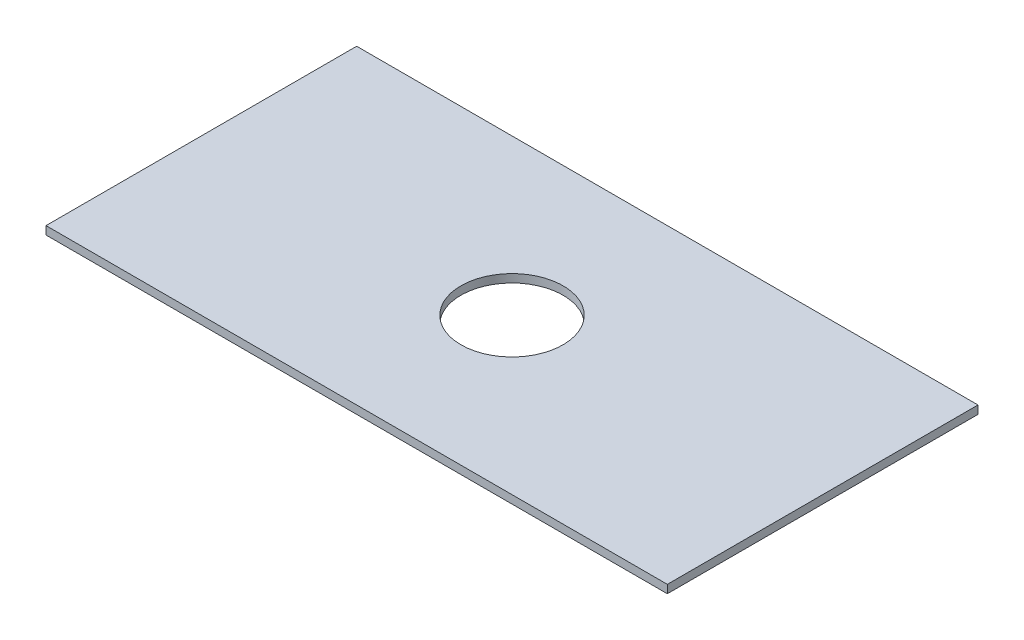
from build123d import *

# Parameters (mm, degrees)
SKETCH1_W           = 304
SKETCH1_H           = 152
BOSS_EXTRUDE2_DEPTH = 4
SKETCH2_R           = 25
CUT_EXTRUDE1_DEPTH  = 10


with BuildPart() as part:
    # Sketch1 → Boss-Extrude2 (new body)
    with BuildSketch(Plane(origin=(0, 0, 0), x_dir=(1, 0, 0), z_dir=(0, 1, 0))):
        Rectangle(SKETCH1_W, SKETCH1_H)
    extrude(amount=BOSS_EXTRUDE2_DEPTH)

    # Sketch2 → Cut-Extrude1 (cut)
    with BuildSketch(Plane(origin=(0, 4, 0), x_dir=(1, 0, 0), z_dir=(0, 1, 0))):
        with Locations(Location((0, 0, 0), (0, 0, 270))):
            Circle(SKETCH2_R)
    extrude(amount=-CUT_EXTRUDE1_DEPTH, mode=Mode.SUBTRACT)


solid = part.part
